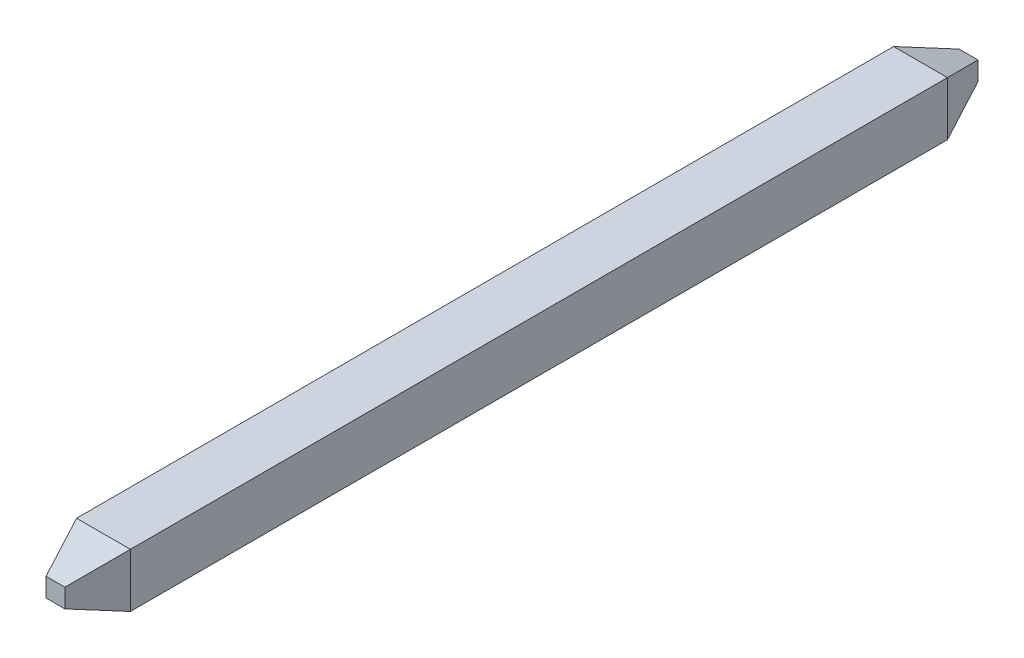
from build123d import *

# Parameters (mm, degrees)
ESQUISSE1_W      = 1.12
ESQUISSE1_H      = 1.12
EXTRUSION1_DEPTH = 17
ESQUISSE2_W      = 1.12
ESQUISSE2_H      = 1.12
EXTRUSION2_DEPTH = 1
EXTRUSION2_TAPER = 20
ESQUISSE3_W      = 1.12
ESQUISSE3_H      = 1.12
EXTRUSION3_DEPTH = 1
EXTRUSION3_TAPER = 20


with BuildPart() as part:
    # Esquisse1 → Extrusion1 (new body)
    with BuildSketch(Plane.XY):
        Rectangle(ESQUISSE1_W, ESQUISSE1_H)
    extrude(amount=EXTRUSION1_DEPTH)

    # Esquisse2 → Extrusion2 (add)
    with BuildSketch(Plane.XY.offset(17)):
        Rectangle(ESQUISSE2_W, ESQUISSE2_H)
    extrude(amount=EXTRUSION2_DEPTH, taper=EXTRUSION2_TAPER)

    # Esquisse3 → Extrusion3 (add)
    with BuildSketch(Plane(origin=(0, 0, 0), x_dir=(-1, 0, 0), z_dir=(0, 0, -1))):
        Rectangle(ESQUISSE3_W, ESQUISSE3_H)
    extrude(amount=EXTRUSION3_DEPTH, taper=EXTRUSION3_TAPER)


solid = part.part
